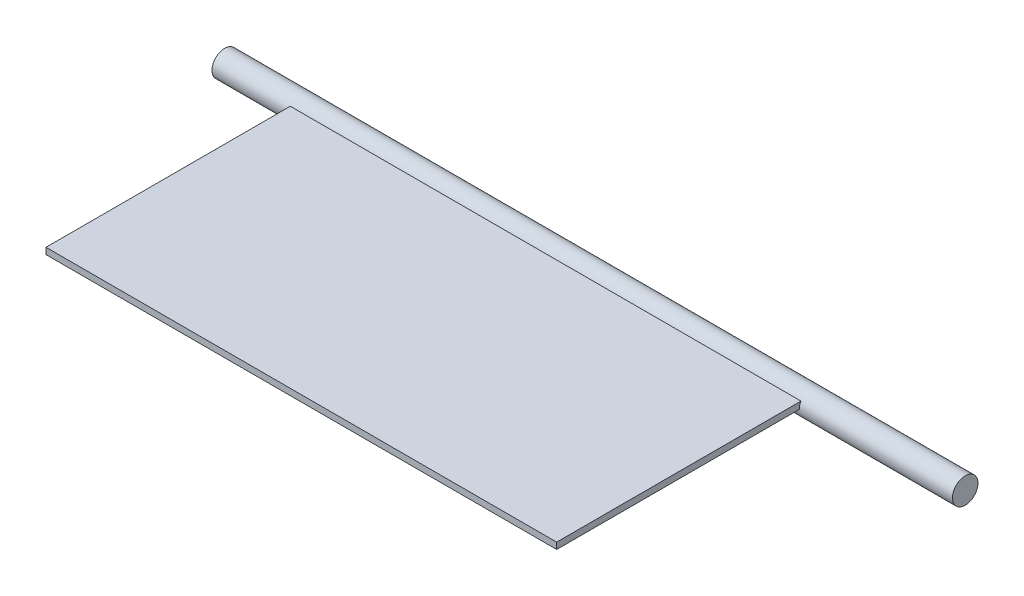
ISO-10303-21;
HEADER;
FILE_DESCRIPTION(('STEP AP214'),'2;1');
FILE_NAME('part.step','',(''),(''),'','','');
FILE_SCHEMA(('AUTOMOTIVE_DESIGN { 1 0 10303 214 1 1 1 1 }'));
ENDSEC;
DATA;
#1=APPLICATION_CONTEXT('core data for automotive mechanical design processes');
#2=APPLICATION_PROTOCOL_DEFINITION('international standard','automotive_design',2000,#1);
#3=PRODUCT_CONTEXT('',#1,'mechanical');
#4=PRODUCT('Part','Part','',(#3));
#5=PRODUCT_RELATED_PRODUCT_CATEGORY('part','',(#4));
#6=PRODUCT_DEFINITION_FORMATION('','',#4);
#7=PRODUCT_DEFINITION_CONTEXT('part definition',#1,'design');
#8=PRODUCT_DEFINITION('design','',#6,#7);
#9=PRODUCT_DEFINITION_SHAPE('','',#8);
#10=(LENGTH_UNIT() NAMED_UNIT(*) SI_UNIT(.MILLI.,.METRE.));
#11=(NAMED_UNIT(*) PLANE_ANGLE_UNIT() SI_UNIT($,.RADIAN.));
#12=(NAMED_UNIT(*) SI_UNIT($,.STERADIAN.) SOLID_ANGLE_UNIT());
#13=UNCERTAINTY_MEASURE_WITH_UNIT(LENGTH_MEASURE(1.E-05),#10,'distance_accuracy_value','');
#14=(GEOMETRIC_REPRESENTATION_CONTEXT(3) GLOBAL_UNCERTAINTY_ASSIGNED_CONTEXT((#13)) GLOBAL_UNIT_ASSIGNED_CONTEXT((#10,
#11,#12)) REPRESENTATION_CONTEXT('',''));
#15=CARTESIAN_POINT('',(0.,0.,0.));
#16=DIRECTION('',(0.,0.,1.));
#17=DIRECTION('',(1.,0.,0.));
#18=AXIS2_PLACEMENT_3D('',#15,#16,#17);
#19=CARTESIAN_POINT('',(0.,0.,0.));
#20=DIRECTION('',(1.,0.,0.));
#21=DIRECTION('',(0.,0.,-1.));
#22=AXIS2_PLACEMENT_3D('',#19,#20,#21);
#23=PLANE('',#22);
#24=CARTESIAN_POINT('',(0.,0.,0.));
#25=DIRECTION('',(1.,0.,0.));
#26=DIRECTION('',(0.,0.,-1.));
#27=AXIS2_PLACEMENT_3D('',#24,#25,#26);
#28=CIRCLE('',#27,10.0000000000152);
#29=CARTESIAN_POINT('',(0.,0.,-10.0000000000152));
#30=VERTEX_POINT('',#29);
#31=EDGE_CURVE('E112',#30,#30,#28,.T.);
#32=ORIENTED_EDGE('',*,*,#31,.F.);
#33=EDGE_LOOP('',(#32));
#34=FACE_BOUND('',#33,.T.);
#35=ADVANCED_FACE('F38',(#34),#23,.F.);
#36=CARTESIAN_POINT('',(460.,0.,200.));
#37=DIRECTION('',(0.,0.,1.));
#38=DIRECTION('',(1.,0.,0.));
#39=AXIS2_PLACEMENT_3D('',#36,#37,#38);
#40=PLANE('',#39);
#41=DIRECTION('',(0.,-1.,0.));
#42=VECTOR('',#41,1.);
#43=CARTESIAN_POINT('',(60.,0.,200.));
#44=LINE('',#43,#42);
#45=CARTESIAN_POINT('',(60.,5.00000000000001,200.));
#46=VERTEX_POINT('',#45);
#47=CARTESIAN_POINT('',(60.,0.,200.));
#48=VERTEX_POINT('',#47);
#49=EDGE_CURVE('E85',#46,#48,#44,.T.);
#50=ORIENTED_EDGE('',*,*,#49,.T.);
#51=DIRECTION('',(-1.,0.,0.));
#52=VECTOR('',#51,1.);
#53=CARTESIAN_POINT('',(460.,0.,200.));
#54=LINE('',#53,#52);
#55=CARTESIAN_POINT('',(460.,0.,200.));
#56=VERTEX_POINT('',#55);
#57=EDGE_CURVE('E12',#56,#48,#54,.T.);
#58=ORIENTED_EDGE('',*,*,#57,.F.);
#59=DIRECTION('',(0.,1.,0.));
#60=VECTOR('',#59,1.);
#61=CARTESIAN_POINT('',(460.,0.,200.));
#62=LINE('',#61,#60);
#63=CARTESIAN_POINT('',(460.,5.00000000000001,200.));
#64=VERTEX_POINT('',#63);
#65=EDGE_CURVE('E107',#56,#64,#62,.T.);
#66=ORIENTED_EDGE('',*,*,#65,.T.);
#67=DIRECTION('',(-1.,0.,0.));
#68=VECTOR('',#67,1.);
#69=CARTESIAN_POINT('',(460.,5.00000000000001,200.));
#70=LINE('',#69,#68);
#71=EDGE_CURVE('E42',#64,#46,#70,.T.);
#72=ORIENTED_EDGE('',*,*,#71,.T.);
#73=EDGE_LOOP('',(#50,#58,#66,#72));
#74=FACE_BOUND('',#73,.T.);
#75=ADVANCED_FACE('F40',(#74),#40,.T.);
#76=CARTESIAN_POINT('',(460.,0.,10.));
#77=DIRECTION('',(0.,-1.,0.));
#78=DIRECTION('',(0.,0.,-1.));
#79=AXIS2_PLACEMENT_3D('',#76,#77,#78);
#80=PLANE('',#79);
#81=DIRECTION('',(0.,0.,-1.));
#82=VECTOR('',#81,1.);
#83=CARTESIAN_POINT('',(60.,0.,10.));
#84=LINE('',#83,#82);
#85=CARTESIAN_POINT('',(60.,0.,10.));
#86=VERTEX_POINT('',#85);
#87=EDGE_CURVE('E115',#48,#86,#84,.T.);
#88=ORIENTED_EDGE('',*,*,#87,.T.);
#89=DIRECTION('',(-1.,0.,0.));
#90=VECTOR('',#89,1.);
#91=CARTESIAN_POINT('',(460.,0.,10.));
#92=LINE('',#91,#90);
#93=CARTESIAN_POINT('',(460.,0.,10.0000000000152));
#94=VERTEX_POINT('',#93);
#95=EDGE_CURVE('E47',#94,#86,#92,.T.);
#96=ORIENTED_EDGE('',*,*,#95,.F.);
#97=DIRECTION('',(0.,0.,1.));
#98=VECTOR('',#97,1.);
#99=CARTESIAN_POINT('',(460.,0.,10.));
#100=LINE('',#99,#98);
#101=EDGE_CURVE('E100',#94,#56,#100,.T.);
#102=ORIENTED_EDGE('',*,*,#101,.T.);
#103=ORIENTED_EDGE('',*,*,#57,.T.);
#104=EDGE_LOOP('',(#88,#96,#102,#103));
#105=FACE_BOUND('',#104,.T.);
#106=ADVANCED_FACE('F118',(#105),#80,.T.);
#107=CARTESIAN_POINT('',(460.,5.00000000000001,200.));
#108=DIRECTION('',(0.,1.,0.));
#109=DIRECTION('',(0.,0.,1.));
#110=AXIS2_PLACEMENT_3D('',#107,#108,#109);
#111=PLANE('',#110);
#112=DIRECTION('',(0.,0.,1.));
#113=VECTOR('',#112,1.);
#114=CARTESIAN_POINT('',(60.,5.00000000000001,200.));
#115=LINE('',#114,#113);
#116=CARTESIAN_POINT('',(60.,4.99999999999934,8.6602540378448));
#117=VERTEX_POINT('',#116);
#118=EDGE_CURVE('E80',#117,#46,#115,.T.);
#119=ORIENTED_EDGE('',*,*,#118,.T.);
#120=ORIENTED_EDGE('',*,*,#71,.F.);
#121=DIRECTION('',(0.,0.,-1.));
#122=VECTOR('',#121,1.);
#123=CARTESIAN_POINT('',(460.,5.00000000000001,200.));
#124=LINE('',#123,#122);
#125=CARTESIAN_POINT('',(460.,4.99999999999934,8.6602540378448));
#126=VERTEX_POINT('',#125);
#127=EDGE_CURVE('E98',#64,#126,#124,.T.);
#128=ORIENTED_EDGE('',*,*,#127,.T.);
#129=DIRECTION('',(-1.,0.,0.));
#130=VECTOR('',#129,1.);
#131=CARTESIAN_POINT('',(460.,4.99999999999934,8.6602540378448));
#132=LINE('',#131,#130);
#133=EDGE_CURVE('E94',#126,#117,#132,.T.);
#134=ORIENTED_EDGE('',*,*,#133,.T.);
#135=EDGE_LOOP('',(#119,#120,#128,#134));
#136=FACE_BOUND('',#135,.T.);
#137=ADVANCED_FACE('F97',(#136),#111,.T.);
#138=CARTESIAN_POINT('',(460.,0.,0.));
#139=DIRECTION('',(1.,0.,0.));
#140=DIRECTION('',(0.,0.,-1.));
#141=AXIS2_PLACEMENT_3D('',#138,#139,#140);
#142=PLANE('',#141);
#143=ORIENTED_EDGE('',*,*,#65,.F.);
#144=ORIENTED_EDGE('',*,*,#101,.F.);
#145=CARTESIAN_POINT('',(460.,0.,0.));
#146=DIRECTION('',(1.,0.,0.));
#147=DIRECTION('',(0.,0.,-1.));
#148=AXIS2_PLACEMENT_3D('',#145,#146,#147);
#149=CIRCLE('',#148,10.);
#150=EDGE_CURVE('E60',#126,#94,#149,.T.);
#151=ORIENTED_EDGE('',*,*,#150,.F.);
#152=ORIENTED_EDGE('',*,*,#127,.F.);
#153=EDGE_LOOP('',(#143,#144,#151,#152));
#154=FACE_BOUND('',#153,.T.);
#155=ADVANCED_FACE('F119',(#154),#142,.T.);
#156=CARTESIAN_POINT('',(0.,0.,0.));
#157=DIRECTION('',(1.,0.,0.));
#158=DIRECTION('',(0.,0.,-1.));
#159=AXIS2_PLACEMENT_3D('',#156,#157,#158);
#160=CYLINDRICAL_SURFACE('',#159,10.0000000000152);
#161=ORIENTED_EDGE('',*,*,#31,.T.);
#162=EDGE_LOOP('',(#161));
#163=FACE_BOUND('',#162,.T.);
#164=CARTESIAN_POINT('',(580.,0.,0.));
#165=DIRECTION('',(1.,0.,0.));
#166=DIRECTION('',(0.,0.,-1.));
#167=AXIS2_PLACEMENT_3D('',#164,#165,#166);
#168=CIRCLE('',#167,10.0000000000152);
#169=CARTESIAN_POINT('',(580.,0.,-10.0000000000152));
#170=VERTEX_POINT('',#169);
#171=EDGE_CURVE('E109',#170,#170,#168,.T.);
#172=ORIENTED_EDGE('',*,*,#171,.F.);
#173=EDGE_LOOP('',(#172));
#174=FACE_BOUND('',#173,.T.);
#175=ORIENTED_EDGE('',*,*,#133,.F.);
#176=ORIENTED_EDGE('',*,*,#150,.T.);
#177=ORIENTED_EDGE('',*,*,#95,.T.);
#178=CARTESIAN_POINT('',(60.,0.,0.));
#179=DIRECTION('',(-1.,0.,0.));
#180=DIRECTION('',(0.,0.,-1.));
#181=AXIS2_PLACEMENT_3D('',#178,#179,#180);
#182=CIRCLE('',#181,10.);
#183=EDGE_CURVE('E83',#86,#117,#182,.T.);
#184=ORIENTED_EDGE('',*,*,#183,.T.);
#185=EDGE_LOOP('',(#175,#176,#177,#184));
#186=FACE_BOUND('',#185,.T.);
#187=ADVANCED_FACE('F93',(#163,#174,#186),#160,.T.);
#188=CARTESIAN_POINT('',(580.,0.,0.));
#189=DIRECTION('',(1.,0.,0.));
#190=DIRECTION('',(0.,0.,-1.));
#191=AXIS2_PLACEMENT_3D('',#188,#189,#190);
#192=PLANE('',#191);
#193=ORIENTED_EDGE('',*,*,#171,.T.);
#194=EDGE_LOOP('',(#193));
#195=FACE_BOUND('',#194,.T.);
#196=ADVANCED_FACE('F126',(#195),#192,.T.);
#197=CARTESIAN_POINT('',(60.,0.,0.));
#198=DIRECTION('',(1.,0.,0.));
#199=DIRECTION('',(0.,0.,-1.));
#200=AXIS2_PLACEMENT_3D('',#197,#198,#199);
#201=PLANE('',#200);
#202=ORIENTED_EDGE('',*,*,#183,.F.);
#203=ORIENTED_EDGE('',*,*,#87,.F.);
#204=ORIENTED_EDGE('',*,*,#49,.F.);
#205=ORIENTED_EDGE('',*,*,#118,.F.);
#206=EDGE_LOOP('',(#202,#203,#204,#205));
#207=FACE_BOUND('',#206,.T.);
#208=ADVANCED_FACE('F82',(#207),#201,.F.);
#209=CLOSED_SHELL('',(#35,#75,#106,#137,#155,#187,#196,#208));
#210=MANIFOLD_SOLID_BREP('B2',#209);
#211=ADVANCED_BREP_SHAPE_REPRESENTATION('',(#18,#210),#14);
#212=SHAPE_DEFINITION_REPRESENTATION(#9,#211);
ENDSEC;
END-ISO-10303-21;
